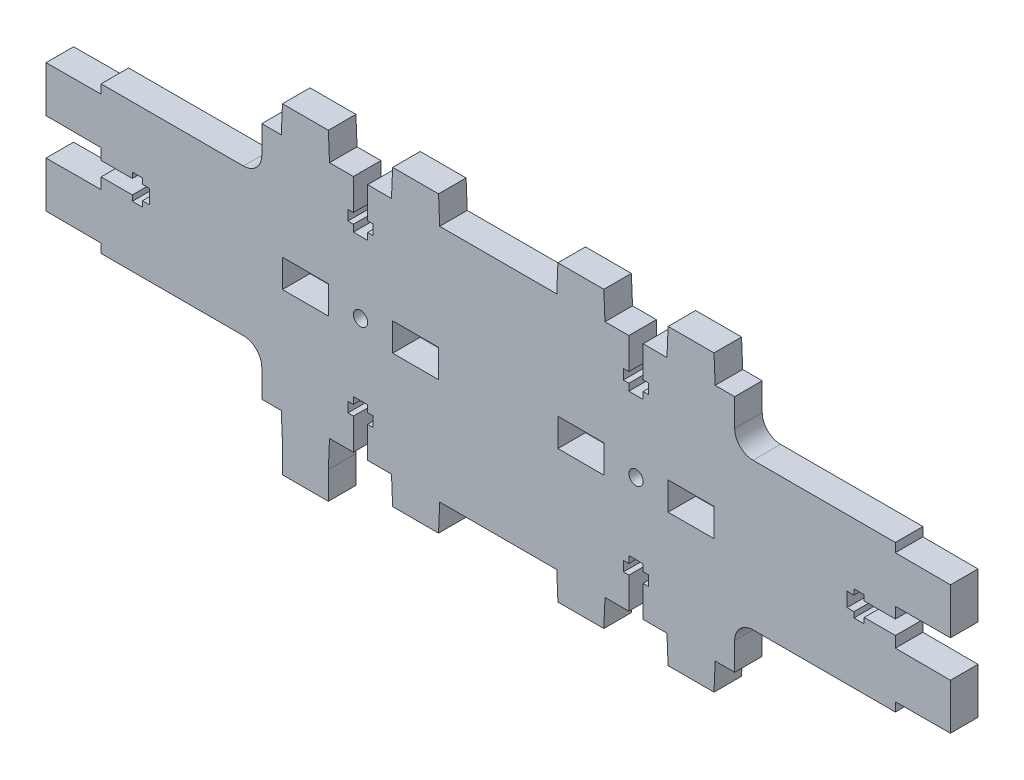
from build123d import *

# Parameters (mm, degrees)
SKETCH_1_R      = 1.55
SKETCH_1_W      = 10
SKETCH_1_H      = 6.1
EXTRUDE_1_DEPTH = 6
FILLET_1_R      = 4
SKETCH_2_W      = 10
SKETCH_2_H      = 6
EXTRUDE_2_DEPTH = 6


with BuildPart() as part:
    # Sketch 1 → Extrude 1 (new body)
    with BuildSketch(Plane.XY):
        Polygon((0, 0), (12.75, 0), (13, -6), (23, -6), (23.25, 0), (28.45, 0), (28.45, 6.8), (27.25, 6.8), (27.25, 9), (28.45, 9), (28.45, 10.5), (31.55, 10.5), (31.55, 9), (32.75, 9), (32.75, 6.8), (31.55, 6.8), (31.55, 0), (36.75, 0), (37, -6), (47, -6), (47.25, 0), (51.5, 0), (51.5, 10), (86.5, 10), (86.5, 11.95), (98.5, 12), (98.5, 22), (86.5, 22.05), (86.5, 24.45), (79.7, 24.45), (79.7, 23.25), (77.5, 23.25), (77.5, 24.45), (76, 24.45), (76, 27.55), (77.5, 27.55), (77.5, 28.75), (79.7, 28.75), (79.7, 27.55), (86.5, 27.55), (86.5, 29.95), (98.5, 30), (98.5, 40), (86.5, 40.05), (86.5, 42), (51.5, 42), (51.5, 52), (47.25, 52), (47, 58), (37, 58), (36.75, 52), (31.55, 52), (31.55, 45.2), (32.75, 45.2), (32.75, 43), (31.55, 43), (31.55, 41.5), (28.45, 41.5), (28.45, 43), (27.25, 43), (27.25, 45.2), (28.45, 45.2), (28.45, 52), (23.25, 52), (23, 58), (13, 58), (12.75, 52), (0, 52), align=None)
        with Locations((30, 26)):
            Circle(SKETCH_1_R, mode=Mode.SUBTRACT)
        with Locations((18, 26)):
            Rectangle(SKETCH_1_W, SKETCH_1_H, mode=Mode.SUBTRACT)
        with Locations((42, 26)):
            Rectangle(SKETCH_1_W, SKETCH_1_H, mode=Mode.SUBTRACT)
    extrude(amount=EXTRUDE_1_DEPTH)

    # Fillet 1
    fillet_1_edges = [part.edges().sort_by_distance(p)[0] for p in [
        (51.5, 42, 3),
        (51.5, 10, 3),
    ]]
    fillet(fillet_1_edges, radius=FILLET_1_R)

    # Mirror 1: part across plane


with BuildPart() as part_1:
    add(part.part)
    add(part.part.mirror(Plane(origin=(0, 0, 6), x_dir=(0, 0, 1), z_dir=(1, 0, 0))))

    # Sketch 2 → Extrude 2 (add)
    with BuildSketch(Plane.XY.offset(6)):
        with Locations((-42, -9)):
            Rectangle(SKETCH_2_W, SKETCH_2_H)
    extrude(amount=-EXTRUDE_2_DEPTH)


solid = part_1.part
